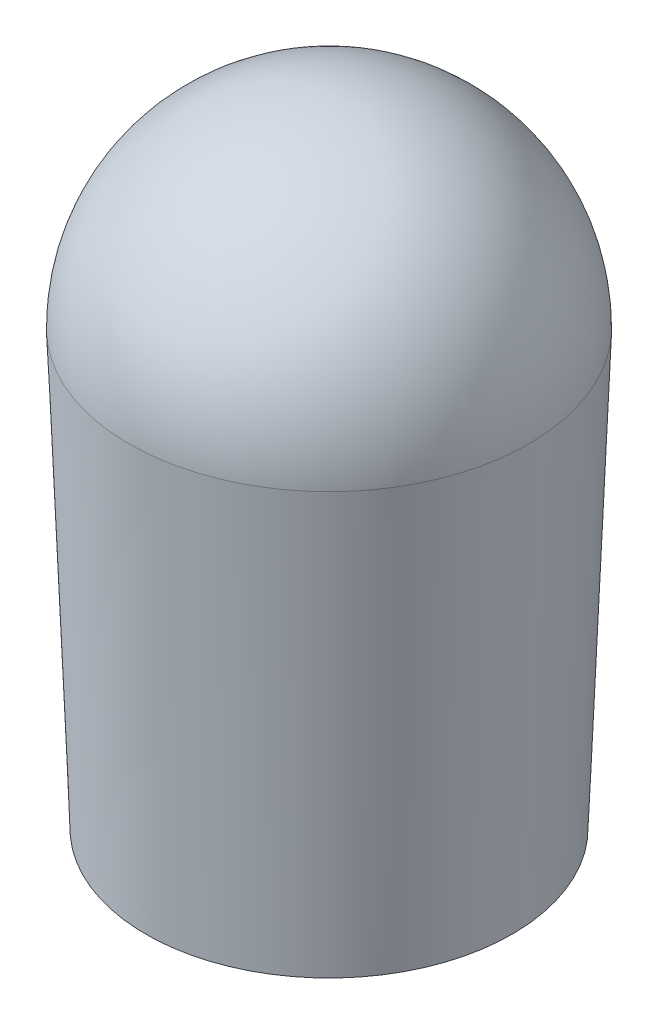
from build123d import *


with BuildPart() as part:
    # Esquisse1 → R_volution1 (revolve)
    with BuildSketch(Plane.XY, mode=Mode.PRIVATE) as r_volution1_sk:
        with BuildLine():
            Line((-5.5, 0), (-4, 0))
            Line((-4, 0), (-4, 15))
            Line((-4, 15), (0, 15))
            Line((0, 15), (0, 19))
            ThreePointArc((0, 19), (-4.242640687, 17.242640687), (-6, 13))
            Line((-6, 13), (-5.5, 0))
        make_face()
    revolve(r_volution1_sk.sketch.rotate(Axis((0, -23.181659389, 0), (0, 1, 0)), 270), axis=Axis((0, -23.181659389, 0), (0, 1, 0)))


solid = part.part
